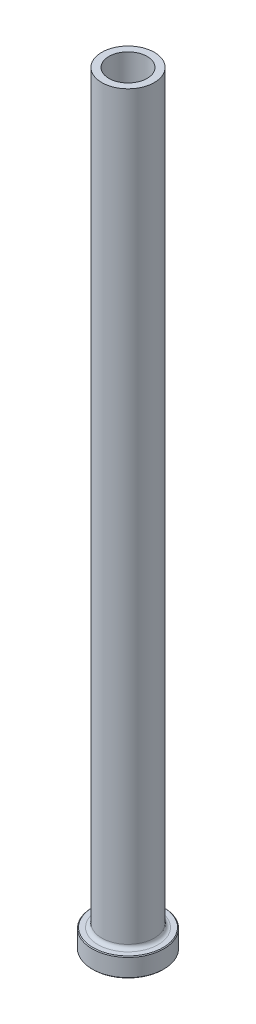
from build123d import *

# Parameters (mm, degrees)
CHAMFER1_SIZE = 0.254


with BuildPart() as part:
    # Sketch1 → Revolve1 (revolve)
    with BuildSketch(Plane.XY, mode=Mode.PRIVATE) as revolve1_sk:
        with BuildLine():
            Line((0, 0), (11.8999, 0))
            Line((11.8999, 0), (11.8999, 6.35))
            Line((11.8999, 6.35), (9.9949, 6.35))
            ThreePointArc((9.9949, 6.35), (9.096874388, 6.721974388), (8.7249, 7.62))
            Line((8.7249, 7.62), (8.7249, 254))
            Line((8.7249, 254), (0, 254))
            Line((0, 254), (0, 0))
        make_face()
    revolve(revolve1_sk.sketch.rotate(Axis((0, 0, 0), (0, 1, 0)), 90), axis=Axis((0, 0, 0), (0, 1, 0)))

    # Sketch2 → Cut-Revolve1 (revolve, cut)
    with BuildSketch(Plane.XY, mode=Mode.PRIVATE) as cut_revolve1_sk:
        Polygon((6.937375, 0), (6.5405, 0.396875), (6.5405, 179.5145), (6.35, 193.802), (6.35, 254), (0, 254), (0, 0), align=None)
    revolve(cut_revolve1_sk.sketch.rotate(Axis((0, 0, 0), (0, 1, 0)), 90), axis=Axis((0, 0, 0), (0, 1, 0)), mode=Mode.SUBTRACT)

    # Chamfer1
    chamfer1_edges = [part.edges().sort_by_distance(p)[0] for p in [
        (0, 6.35, 11.8999),
        (0, 0, 11.8999),
    ]]
    chamfer(chamfer1_edges, length=CHAMFER1_SIZE)


solid = part.part
